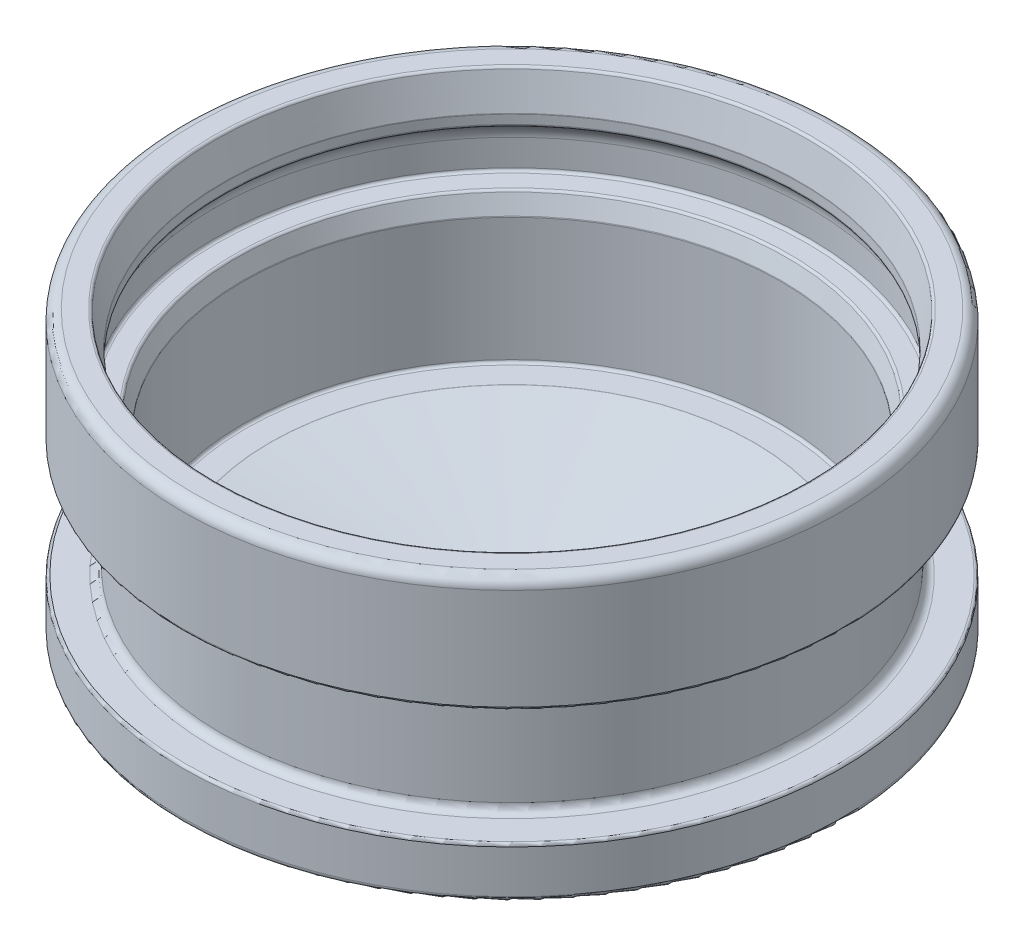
from build123d import *


with BuildPart() as part:
    # Sketch1 → Revolve1 (revolve)
    with BuildSketch(Plane.XY, mode=Mode.PRIVATE) as revolve1_sk:
        with BuildLine():
            Line((-14.137963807, 0), (-15.0495, 0))
            ThreePointArc((-15.0495, 0), (-15.408710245, -0.148789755), (-15.5575, -0.508))
            Line((-15.5575, -0.508), (-15.5575, -5.2832))
            ThreePointArc((-15.5575, -5.2832), (-15.520302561, -5.373002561), (-15.4305, -5.4102))
            Line((-15.4305, -5.4102), (-14.097, -5.4102))
            ThreePointArc((-14.097, -5.4102), (-13.827592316, -5.521792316), (-13.716, -5.7912))
            Line((-13.716, -5.7912), (-13.716, -10.4902))
            ThreePointArc((-13.716, -10.4902), (-13.827592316, -10.759607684), (-14.097, -10.8712))
            Line((-14.097, -10.8712), (-15.4305, -10.8712))
            ThreePointArc((-15.4305, -10.8712), (-15.520302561, -10.908397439), (-15.5575, -10.9982))
            Line((-15.5575, -10.9982), (-15.5575, -13.0302))
            ThreePointArc((-15.5575, -13.0302), (-15.483105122, -13.209805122), (-15.3035, -13.2842))
            Line((-15.3035, -13.2842), (-1.8034, -13.2842))
            ThreePointArc((-1.8034, -13.2842), (-1.749518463, -13.261881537), (-1.7272, -13.208))
            Line((-1.7272, -13.208), (-1.7272, -12.967033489))
            ThreePointArc((-1.7272, -12.967033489), (-1.744987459, -12.918100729), (-1.790045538, -12.892012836))
            Line((-1.790045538, -12.892012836), (-11.423374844, -11.177179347))
            ThreePointArc((-11.423374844, -11.177179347), (-11.430026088, -11.176295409), (-11.436729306, -11.176))
            Line((-11.436729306, -11.176), (-12.573, -11.176))
            ThreePointArc((-12.573, -11.176), (-12.662802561, -11.138802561), (-12.7, -11.049))
            Line((-12.7, -11.049), (-12.7, -5.229393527))
            ThreePointArc((-12.7, -5.229393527), (-12.701929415, -5.207340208), (-12.707659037, -5.185956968))
            Line((-12.707659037, -5.185956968), (-12.993154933, -4.401563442))
            ThreePointArc((-12.993154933, -4.401563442), (-13.039651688, -4.34096769), (-13.112495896, -4.318))
            Line((-13.112495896, -4.318), (-13.97, -4.318))
            ThreePointArc((-13.97, -4.318), (-14.059802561, -4.280802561), (-14.097, -4.191))
            Line((-14.097, -4.191), (-14.097, -2.943012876))
            ThreePointArc((-14.097, -2.943012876), (-13.987460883, -2.515506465), (-13.6858375, -2.193351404))
            ThreePointArc((-13.6858375, -2.193351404), (-13.642748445, -2.147329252), (-13.6271, -2.086256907))
            Line((-13.6271, -2.086256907), (-13.6271, -1.666593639))
            ThreePointArc((-13.6271, -1.666593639), (-13.628046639, -1.651116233), (-13.630872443, -1.635869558))
            Line((-13.630872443, -1.635869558), (-14.01473625, -0.096275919))
            ThreePointArc((-14.01473625, -0.096275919), (-14.0597748, -0.026922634), (-14.137963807, 0))
        make_face()
    revolve(revolve1_sk.sketch.rotate(Axis((0, 0, 0), (0, -1, 0)), 270), axis=Axis((0, 0, 0), (0, -1, 0)))


solid = part.part
